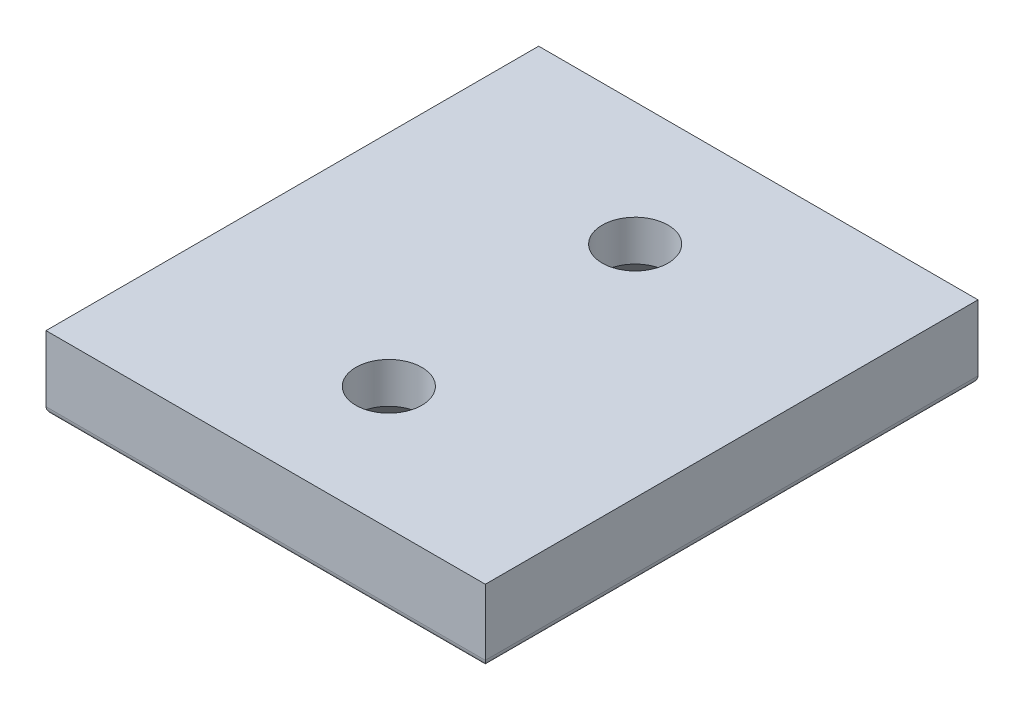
ISO-10303-21;
HEADER;
FILE_DESCRIPTION(('STEP AP214'),'2;1');
FILE_NAME('part.step','',(''),(''),'','','');
FILE_SCHEMA(('AUTOMOTIVE_DESIGN { 1 0 10303 214 1 1 1 1 }'));
ENDSEC;
DATA;
#1=APPLICATION_CONTEXT('core data for automotive mechanical design processes');
#2=APPLICATION_PROTOCOL_DEFINITION('international standard','automotive_design',2000,#1);
#3=PRODUCT_CONTEXT('',#1,'mechanical');
#4=PRODUCT('Part','Part','',(#3));
#5=PRODUCT_RELATED_PRODUCT_CATEGORY('part','',(#4));
#6=PRODUCT_DEFINITION_FORMATION('','',#4);
#7=PRODUCT_DEFINITION_CONTEXT('part definition',#1,'design');
#8=PRODUCT_DEFINITION('design','',#6,#7);
#9=PRODUCT_DEFINITION_SHAPE('','',#8);
#10=(LENGTH_UNIT() NAMED_UNIT(*) SI_UNIT(.MILLI.,.METRE.));
#11=(NAMED_UNIT(*) PLANE_ANGLE_UNIT() SI_UNIT($,.RADIAN.));
#12=(NAMED_UNIT(*) SI_UNIT($,.STERADIAN.) SOLID_ANGLE_UNIT());
#13=UNCERTAINTY_MEASURE_WITH_UNIT(LENGTH_MEASURE(1.E-05),#10,'distance_accuracy_value','');
#14=(GEOMETRIC_REPRESENTATION_CONTEXT(3) GLOBAL_UNCERTAINTY_ASSIGNED_CONTEXT((#13)) GLOBAL_UNIT_ASSIGNED_CONTEXT((#10,
#11,#12)) REPRESENTATION_CONTEXT('',''));
#15=CARTESIAN_POINT('',(0.,0.,0.));
#16=DIRECTION('',(0.,0.,1.));
#17=DIRECTION('',(1.,0.,0.));
#18=AXIS2_PLACEMENT_3D('',#15,#16,#17);
#19=CARTESIAN_POINT('',(30.,10.,33.64));
#20=DIRECTION('',(-1.,0.,0.));
#21=DIRECTION('',(0.,0.,1.));
#22=AXIS2_PLACEMENT_3D('',#19,#20,#21);
#23=PLANE('',#22);
#24=DIRECTION('',(0.,-1.,0.));
#25=VECTOR('',#24,1.);
#26=CARTESIAN_POINT('',(30.,10.,33.64));
#27=LINE('',#26,#25);
#28=CARTESIAN_POINT('',(30.,10.,33.64));
#29=VERTEX_POINT('',#28);
#30=CARTESIAN_POINT('',(30.,0.999999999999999,33.64));
#31=VERTEX_POINT('',#30);
#32=EDGE_CURVE('E153',#29,#31,#27,.T.);
#33=ORIENTED_EDGE('',*,*,#32,.T.);
#34=DIRECTION('',(0.,0.,-1.));
#35=VECTOR('',#34,1.);
#36=CARTESIAN_POINT('',(30.,0.999999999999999,-33.64));
#37=LINE('',#36,#35);
#38=CARTESIAN_POINT('',(30.,0.999999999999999,-33.64));
#39=VERTEX_POINT('',#38);
#40=EDGE_CURVE('E11',#31,#39,#37,.T.);
#41=ORIENTED_EDGE('',*,*,#40,.T.);
#42=DIRECTION('',(0.,-1.,0.));
#43=VECTOR('',#42,1.);
#44=CARTESIAN_POINT('',(30.,10.,-33.64));
#45=LINE('',#44,#43);
#46=CARTESIAN_POINT('',(30.,10.,-33.64));
#47=VERTEX_POINT('',#46);
#48=EDGE_CURVE('E94',#47,#39,#45,.T.);
#49=ORIENTED_EDGE('',*,*,#48,.F.);
#50=DIRECTION('',(0.,0.,-1.));
#51=VECTOR('',#50,1.);
#52=CARTESIAN_POINT('',(30.,10.,33.64));
#53=LINE('',#52,#51);
#54=EDGE_CURVE('E100',#29,#47,#53,.T.);
#55=ORIENTED_EDGE('',*,*,#54,.F.);
#56=EDGE_LOOP('',(#33,#41,#49,#55));
#57=FACE_BOUND('',#56,.T.);
#58=ADVANCED_FACE('F33',(#57),#23,.F.);
#59=CARTESIAN_POINT('',(-30.,10.,-33.64));
#60=DIRECTION('',(0.,0.,1.));
#61=DIRECTION('',(1.,0.,0.));
#62=AXIS2_PLACEMENT_3D('',#59,#60,#61);
#63=PLANE('',#62);
#64=ORIENTED_EDGE('',*,*,#48,.T.);
#65=DIRECTION('',(-1.,0.,0.));
#66=VECTOR('',#65,1.);
#67=CARTESIAN_POINT('',(-30.,0.999999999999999,-33.64));
#68=LINE('',#67,#66);
#69=CARTESIAN_POINT('',(-30.,0.999999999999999,-33.64));
#70=VERTEX_POINT('',#69);
#71=EDGE_CURVE('E109',#39,#70,#68,.T.);
#72=ORIENTED_EDGE('',*,*,#71,.T.);
#73=DIRECTION('',(0.,-1.,0.));
#74=VECTOR('',#73,1.);
#75=CARTESIAN_POINT('',(-30.,10.,-33.64));
#76=LINE('',#75,#74);
#77=CARTESIAN_POINT('',(-30.,10.,-33.64));
#78=VERTEX_POINT('',#77);
#79=EDGE_CURVE('E96',#78,#70,#76,.T.);
#80=ORIENTED_EDGE('',*,*,#79,.F.);
#81=DIRECTION('',(-1.,0.,0.));
#82=VECTOR('',#81,1.);
#83=CARTESIAN_POINT('',(-30.,10.,-33.64));
#84=LINE('',#83,#82);
#85=EDGE_CURVE('E89',#47,#78,#84,.T.);
#86=ORIENTED_EDGE('',*,*,#85,.F.);
#87=EDGE_LOOP('',(#64,#72,#80,#86));
#88=FACE_BOUND('',#87,.T.);
#89=ADVANCED_FACE('F91',(#88),#63,.F.);
#90=CARTESIAN_POINT('',(-30.,10.,33.64));
#91=DIRECTION('',(1.,0.,0.));
#92=DIRECTION('',(0.,0.,-1.));
#93=AXIS2_PLACEMENT_3D('',#90,#91,#92);
#94=PLANE('',#93);
#95=ORIENTED_EDGE('',*,*,#79,.T.);
#96=DIRECTION('',(0.,0.,1.));
#97=VECTOR('',#96,1.);
#98=CARTESIAN_POINT('',(-30.,0.999999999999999,33.64));
#99=LINE('',#98,#97);
#100=CARTESIAN_POINT('',(-30.,0.999999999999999,33.64));
#101=VERTEX_POINT('',#100);
#102=EDGE_CURVE('E57',#70,#101,#99,.T.);
#103=ORIENTED_EDGE('',*,*,#102,.T.);
#104=DIRECTION('',(0.,-1.,0.));
#105=VECTOR('',#104,1.);
#106=CARTESIAN_POINT('',(-30.,10.,33.64));
#107=LINE('',#106,#105);
#108=CARTESIAN_POINT('',(-30.,10.,33.64));
#109=VERTEX_POINT('',#108);
#110=EDGE_CURVE('E113',#109,#101,#107,.T.);
#111=ORIENTED_EDGE('',*,*,#110,.F.);
#112=DIRECTION('',(0.,0.,1.));
#113=VECTOR('',#112,1.);
#114=CARTESIAN_POINT('',(-30.,10.,33.64));
#115=LINE('',#114,#113);
#116=EDGE_CURVE('E99',#78,#109,#115,.T.);
#117=ORIENTED_EDGE('',*,*,#116,.F.);
#118=EDGE_LOOP('',(#95,#103,#111,#117));
#119=FACE_BOUND('',#118,.T.);
#120=ADVANCED_FACE('F151',(#119),#94,.F.);
#121=CARTESIAN_POINT('',(-30.,10.,33.64));
#122=DIRECTION('',(0.,0.,-1.));
#123=DIRECTION('',(-1.,0.,0.));
#124=AXIS2_PLACEMENT_3D('',#121,#122,#123);
#125=PLANE('',#124);
#126=ORIENTED_EDGE('',*,*,#110,.T.);
#127=DIRECTION('',(1.,0.,0.));
#128=VECTOR('',#127,1.);
#129=CARTESIAN_POINT('',(30.,0.999999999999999,33.64));
#130=LINE('',#129,#128);
#131=EDGE_CURVE('E42',#101,#31,#130,.T.);
#132=ORIENTED_EDGE('',*,*,#131,.T.);
#133=ORIENTED_EDGE('',*,*,#32,.F.);
#134=DIRECTION('',(1.,0.,0.));
#135=VECTOR('',#134,1.);
#136=CARTESIAN_POINT('',(-30.,10.,33.64));
#137=LINE('',#136,#135);
#138=EDGE_CURVE('E105',#109,#29,#137,.T.);
#139=ORIENTED_EDGE('',*,*,#138,.F.);
#140=EDGE_LOOP('',(#126,#132,#133,#139));
#141=FACE_BOUND('',#140,.T.);
#142=ADVANCED_FACE('F156',(#141),#125,.F.);
#143=CARTESIAN_POINT('',(0.,10.,0.));
#144=DIRECTION('',(0.,-1.,0.));
#145=DIRECTION('',(0.,0.,-1.));
#146=AXIS2_PLACEMENT_3D('',#143,#144,#145);
#147=PLANE('',#146);
#148=CARTESIAN_POINT('',(0.,9.99999999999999,-16.82));
#149=DIRECTION('',(0.,-1.,0.));
#150=DIRECTION('',(0.,0.,-1.));
#151=AXIS2_PLACEMENT_3D('',#148,#149,#150);
#152=CIRCLE('',#151,4.49999999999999);
#153=CARTESIAN_POINT('',(0.,9.99999999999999,-21.32));
#154=VERTEX_POINT('',#153);
#155=EDGE_CURVE('E214',#154,#154,#152,.T.);
#156=ORIENTED_EDGE('',*,*,#155,.T.);
#157=EDGE_LOOP('',(#156));
#158=FACE_BOUND('',#157,.T.);
#159=CARTESIAN_POINT('',(0.,9.99999999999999,16.82));
#160=DIRECTION('',(0.,-1.,0.));
#161=DIRECTION('',(0.,0.,-1.));
#162=AXIS2_PLACEMENT_3D('',#159,#160,#161);
#163=CIRCLE('',#162,4.49999999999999);
#164=CARTESIAN_POINT('',(0.,9.99999999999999,12.32));
#165=VERTEX_POINT('',#164);
#166=EDGE_CURVE('E130',#165,#165,#163,.T.);
#167=ORIENTED_EDGE('',*,*,#166,.T.);
#168=EDGE_LOOP('',(#167));
#169=FACE_BOUND('',#168,.T.);
#170=ORIENTED_EDGE('',*,*,#54,.T.);
#171=ORIENTED_EDGE('',*,*,#85,.T.);
#172=ORIENTED_EDGE('',*,*,#116,.T.);
#173=ORIENTED_EDGE('',*,*,#138,.T.);
#174=EDGE_LOOP('',(#170,#171,#172,#173));
#175=FACE_BOUND('',#174,.T.);
#176=ADVANCED_FACE('F103',(#158,#169,#175),#147,.F.);
#177=CARTESIAN_POINT('',(0.,0.,0.));
#178=DIRECTION('',(0.,-1.,0.));
#179=DIRECTION('',(0.,0.,-1.));
#180=AXIS2_PLACEMENT_3D('',#177,#178,#179);
#181=PLANE('',#180);
#182=CARTESIAN_POINT('',(0.,0.,-16.82));
#183=DIRECTION('',(0.,-1.,0.));
#184=DIRECTION('',(0.,0.,-1.));
#185=AXIS2_PLACEMENT_3D('',#182,#183,#184);
#186=CIRCLE('',#185,8.96);
#187=CARTESIAN_POINT('',(0.,0.,-25.78));
#188=VERTEX_POINT('',#187);
#189=EDGE_CURVE('E212',#188,#188,#186,.T.);
#190=ORIENTED_EDGE('',*,*,#189,.F.);
#191=EDGE_LOOP('',(#190));
#192=FACE_BOUND('',#191,.T.);
#193=CARTESIAN_POINT('',(0.,0.,16.82));
#194=DIRECTION('',(0.,-1.,0.));
#195=DIRECTION('',(0.,0.,-1.));
#196=AXIS2_PLACEMENT_3D('',#193,#194,#195);
#197=CIRCLE('',#196,8.96);
#198=CARTESIAN_POINT('',(0.,0.,7.86));
#199=VERTEX_POINT('',#198);
#200=EDGE_CURVE('E219',#199,#199,#197,.T.);
#201=ORIENTED_EDGE('',*,*,#200,.F.);
#202=EDGE_LOOP('',(#201));
#203=FACE_BOUND('',#202,.T.);
#204=DIRECTION('',(0.,0.,1.));
#205=VECTOR('',#204,1.);
#206=CARTESIAN_POINT('',(-29.,0.,-33.64));
#207=LINE('',#206,#205);
#208=CARTESIAN_POINT('',(-29.,0.,32.64));
#209=VERTEX_POINT('',#208);
#210=CARTESIAN_POINT('',(-29.,0.,-32.64));
#211=VERTEX_POINT('',#210);
#212=EDGE_CURVE('E120',#209,#211,#207,.F.);
#213=ORIENTED_EDGE('',*,*,#212,.T.);
#214=DIRECTION('',(-1.,0.,0.));
#215=VECTOR('',#214,1.);
#216=CARTESIAN_POINT('',(30.,0.,-32.64));
#217=LINE('',#216,#215);
#218=CARTESIAN_POINT('',(29.,0.,-32.64));
#219=VERTEX_POINT('',#218);
#220=EDGE_CURVE('E122',#211,#219,#217,.F.);
#221=ORIENTED_EDGE('',*,*,#220,.T.);
#222=DIRECTION('',(0.,0.,-1.));
#223=VECTOR('',#222,1.);
#224=CARTESIAN_POINT('',(29.,0.,33.64));
#225=LINE('',#224,#223);
#226=CARTESIAN_POINT('',(29.,0.,32.64));
#227=VERTEX_POINT('',#226);
#228=EDGE_CURVE('E111',#219,#227,#225,.F.);
#229=ORIENTED_EDGE('',*,*,#228,.T.);
#230=DIRECTION('',(1.,0.,0.));
#231=VECTOR('',#230,1.);
#232=CARTESIAN_POINT('',(-30.,0.,32.64));
#233=LINE('',#232,#231);
#234=EDGE_CURVE('E118',#227,#209,#233,.F.);
#235=ORIENTED_EDGE('',*,*,#234,.T.);
#236=EDGE_LOOP('',(#213,#221,#229,#235));
#237=FACE_BOUND('',#236,.T.);
#238=ADVANCED_FACE('F144',(#192,#203,#237),#181,.T.);
#239=CARTESIAN_POINT('',(-30.,0.999999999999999,32.64));
#240=DIRECTION('',(-1.,0.,0.));
#241=DIRECTION('',(0.,0.,1.));
#242=AXIS2_PLACEMENT_3D('',#239,#240,#241);
#243=CYLINDRICAL_SURFACE('',#242,1.);
#244=CARTESIAN_POINT('',(-29.,0.999999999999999,32.64));
#245=DIRECTION('',(-0.707106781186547,0.,-0.707106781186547));
#246=DIRECTION('',(-0.707106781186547,0.,0.707106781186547));
#247=AXIS2_PLACEMENT_3D('',#244,#245,#246);
#248=ELLIPSE('',#247,1.41421356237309,1.);
#249=EDGE_CURVE('E131',#209,#101,#248,.T.);
#250=ORIENTED_EDGE('',*,*,#249,.F.);
#251=ORIENTED_EDGE('',*,*,#234,.F.);
#252=CARTESIAN_POINT('',(29.,0.999999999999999,32.64));
#253=DIRECTION('',(-0.707106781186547,0.,0.707106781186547));
#254=DIRECTION('',(0.707106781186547,0.,0.707106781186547));
#255=AXIS2_PLACEMENT_3D('',#252,#253,#254);
#256=ELLIPSE('',#255,1.41421356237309,1.);
#257=EDGE_CURVE('E37',#31,#227,#256,.F.);
#258=ORIENTED_EDGE('',*,*,#257,.F.);
#259=ORIENTED_EDGE('',*,*,#131,.F.);
#260=EDGE_LOOP('',(#250,#251,#258,#259));
#261=FACE_BOUND('',#260,.T.);
#262=ADVANCED_FACE('F35',(#261),#243,.T.);
#263=CARTESIAN_POINT('',(29.,0.999999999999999,33.64));
#264=DIRECTION('',(0.,0.,1.));
#265=DIRECTION('',(1.,0.,0.));
#266=AXIS2_PLACEMENT_3D('',#263,#264,#265);
#267=CYLINDRICAL_SURFACE('',#266,1.);
#268=ORIENTED_EDGE('',*,*,#257,.T.);
#269=ORIENTED_EDGE('',*,*,#228,.F.);
#270=CARTESIAN_POINT('',(29.,0.999999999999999,-32.64));
#271=DIRECTION('',(0.707106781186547,0.,0.707106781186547));
#272=DIRECTION('',(-0.707106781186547,0.,0.707106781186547));
#273=AXIS2_PLACEMENT_3D('',#270,#271,#272);
#274=ELLIPSE('',#273,1.41421356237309,1.);
#275=EDGE_CURVE('E129',#39,#219,#274,.F.);
#276=ORIENTED_EDGE('',*,*,#275,.F.);
#277=ORIENTED_EDGE('',*,*,#40,.F.);
#278=EDGE_LOOP('',(#268,#269,#276,#277));
#279=FACE_BOUND('',#278,.T.);
#280=ADVANCED_FACE('F140',(#279),#267,.T.);
#281=CARTESIAN_POINT('',(-29.,0.999999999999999,33.64));
#282=DIRECTION('',(0.,0.,-1.));
#283=DIRECTION('',(-1.,0.,0.));
#284=AXIS2_PLACEMENT_3D('',#281,#282,#283);
#285=CYLINDRICAL_SURFACE('',#284,1.);
#286=ORIENTED_EDGE('',*,*,#249,.T.);
#287=ORIENTED_EDGE('',*,*,#102,.F.);
#288=CARTESIAN_POINT('',(-29.,0.999999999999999,-32.64));
#289=DIRECTION('',(0.707106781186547,0.,-0.707106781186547));
#290=DIRECTION('',(-0.707106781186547,0.,-0.707106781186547));
#291=AXIS2_PLACEMENT_3D('',#288,#289,#290);
#292=ELLIPSE('',#291,1.41421356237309,1.);
#293=EDGE_CURVE('E127',#211,#70,#292,.T.);
#294=ORIENTED_EDGE('',*,*,#293,.F.);
#295=ORIENTED_EDGE('',*,*,#212,.F.);
#296=EDGE_LOOP('',(#286,#287,#294,#295));
#297=FACE_BOUND('',#296,.T.);
#298=ADVANCED_FACE('F150',(#297),#285,.T.);
#299=CARTESIAN_POINT('',(-30.,0.999999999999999,-32.64));
#300=DIRECTION('',(1.,0.,0.));
#301=DIRECTION('',(0.,0.,-1.));
#302=AXIS2_PLACEMENT_3D('',#299,#300,#301);
#303=CYLINDRICAL_SURFACE('',#302,1.);
#304=ORIENTED_EDGE('',*,*,#275,.T.);
#305=ORIENTED_EDGE('',*,*,#220,.F.);
#306=ORIENTED_EDGE('',*,*,#293,.T.);
#307=ORIENTED_EDGE('',*,*,#71,.F.);
#308=EDGE_LOOP('',(#304,#305,#306,#307));
#309=FACE_BOUND('',#308,.T.);
#310=ADVANCED_FACE('F148',(#309),#303,.T.);
#311=CARTESIAN_POINT('',(0.,0.,16.82));
#312=DIRECTION('',(0.,-1.,0.));
#313=DIRECTION('',(0.,0.,-1.));
#314=AXIS2_PLACEMENT_3D('',#311,#312,#313);
#315=CYLINDRICAL_SURFACE('',#314,4.49999999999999);
#316=ORIENTED_EDGE('',*,*,#166,.F.);
#317=EDGE_LOOP('',(#316));
#318=FACE_BOUND('',#317,.T.);
#319=CARTESIAN_POINT('',(0.,4.46,16.82));
#320=DIRECTION('',(0.,-1.,0.));
#321=DIRECTION('',(0.,0.,-1.));
#322=AXIS2_PLACEMENT_3D('',#319,#320,#321);
#323=CIRCLE('',#322,4.5);
#324=CARTESIAN_POINT('',(0.,4.46,12.32));
#325=VERTEX_POINT('',#324);
#326=EDGE_CURVE('E222',#325,#325,#323,.T.);
#327=ORIENTED_EDGE('',*,*,#326,.T.);
#328=EDGE_LOOP('',(#327));
#329=FACE_BOUND('',#328,.T.);
#330=ADVANCED_FACE('F176',(#318,#329),#315,.F.);
#331=CARTESIAN_POINT('',(0.,0.,16.82));
#332=DIRECTION('',(0.,-1.,0.));
#333=DIRECTION('',(0.,0.,-1.));
#334=AXIS2_PLACEMENT_3D('',#331,#332,#333);
#335=CONICAL_SURFACE('',#334,8.96,0.785398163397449);
#336=ORIENTED_EDGE('',*,*,#326,.F.);
#337=EDGE_LOOP('',(#336));
#338=FACE_BOUND('',#337,.T.);
#339=ORIENTED_EDGE('',*,*,#200,.T.);
#340=EDGE_LOOP('',(#339));
#341=FACE_BOUND('',#340,.T.);
#342=ADVANCED_FACE('F193',(#338,#341),#335,.F.);
#343=CARTESIAN_POINT('',(0.,0.,-16.82));
#344=DIRECTION('',(0.,-1.,0.));
#345=DIRECTION('',(0.,0.,-1.));
#346=AXIS2_PLACEMENT_3D('',#343,#344,#345);
#347=CYLINDRICAL_SURFACE('',#346,4.49999999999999);
#348=ORIENTED_EDGE('',*,*,#155,.F.);
#349=EDGE_LOOP('',(#348));
#350=FACE_BOUND('',#349,.T.);
#351=CARTESIAN_POINT('',(0.,4.46,-16.82));
#352=DIRECTION('',(0.,-1.,0.));
#353=DIRECTION('',(0.,0.,-1.));
#354=AXIS2_PLACEMENT_3D('',#351,#352,#353);
#355=CIRCLE('',#354,4.5);
#356=CARTESIAN_POINT('',(0.,4.46,-21.32));
#357=VERTEX_POINT('',#356);
#358=EDGE_CURVE('E210',#357,#357,#355,.T.);
#359=ORIENTED_EDGE('',*,*,#358,.T.);
#360=EDGE_LOOP('',(#359));
#361=FACE_BOUND('',#360,.T.);
#362=ADVANCED_FACE('F197',(#350,#361),#347,.F.);
#363=CARTESIAN_POINT('',(0.,0.,-16.82));
#364=DIRECTION('',(0.,-1.,0.));
#365=DIRECTION('',(0.,0.,-1.));
#366=AXIS2_PLACEMENT_3D('',#363,#364,#365);
#367=CONICAL_SURFACE('',#366,8.96,0.785398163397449);
#368=ORIENTED_EDGE('',*,*,#358,.F.);
#369=EDGE_LOOP('',(#368));
#370=FACE_BOUND('',#369,.T.);
#371=ORIENTED_EDGE('',*,*,#189,.T.);
#372=EDGE_LOOP('',(#371));
#373=FACE_BOUND('',#372,.T.);
#374=ADVANCED_FACE('F201',(#370,#373),#367,.F.);
#375=CLOSED_SHELL('',(#58,#89,#120,#142,#176,#238,#262,#280,#298,#310,#330,#342,#362,#374));
#376=MANIFOLD_SOLID_BREP('B2',#375);
#377=ADVANCED_BREP_SHAPE_REPRESENTATION('',(#18,#376),#14);
#378=SHAPE_DEFINITION_REPRESENTATION(#9,#377);
ENDSEC;
END-ISO-10303-21;
